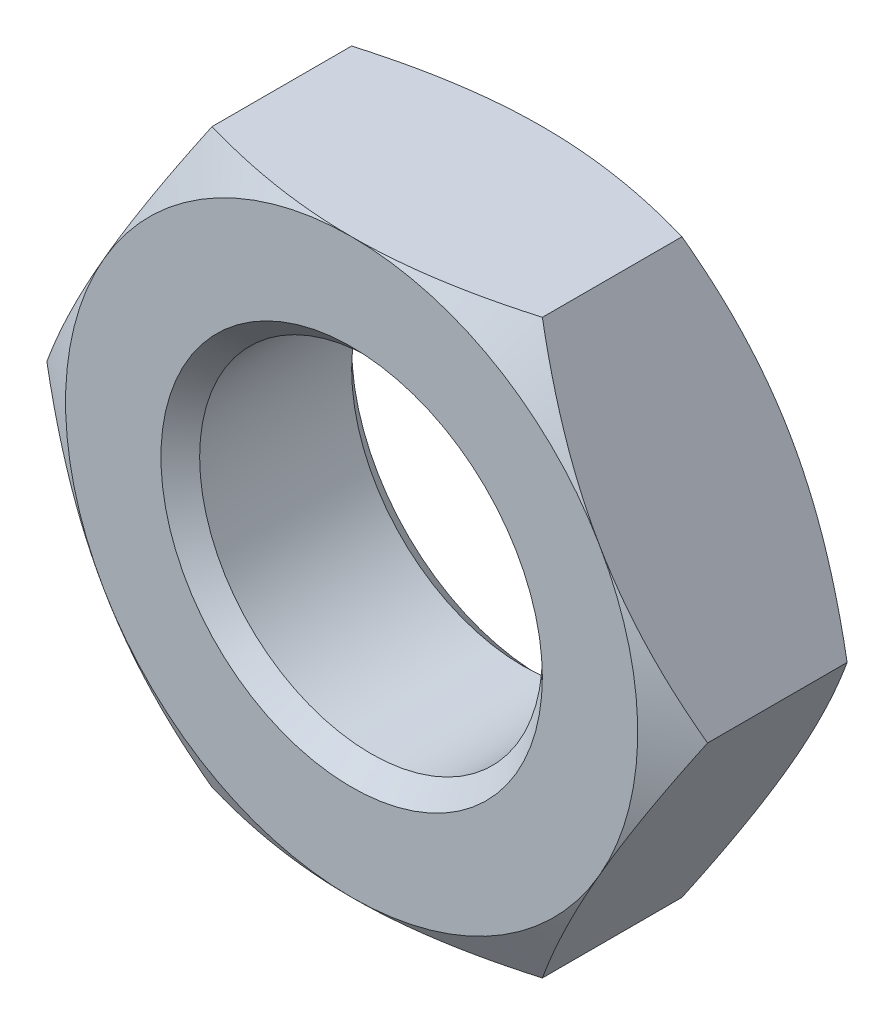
ISO-10303-21;
HEADER;
FILE_DESCRIPTION(('STEP AP214'),'2;1');
FILE_NAME('part.step','',(''),(''),'','','');
FILE_SCHEMA(('AUTOMOTIVE_DESIGN { 1 0 10303 214 1 1 1 1 }'));
ENDSEC;
DATA;
#1=APPLICATION_CONTEXT('core data for automotive mechanical design processes');
#2=APPLICATION_PROTOCOL_DEFINITION('international standard','automotive_design',2000,#1);
#3=PRODUCT_CONTEXT('',#1,'mechanical');
#4=PRODUCT('Part','Part','',(#3));
#5=PRODUCT_RELATED_PRODUCT_CATEGORY('part','',(#4));
#6=PRODUCT_DEFINITION_FORMATION('','',#4);
#7=PRODUCT_DEFINITION_CONTEXT('part definition',#1,'design');
#8=PRODUCT_DEFINITION('design','',#6,#7);
#9=PRODUCT_DEFINITION_SHAPE('','',#8);
#10=(LENGTH_UNIT() NAMED_UNIT(*) SI_UNIT(.MILLI.,.METRE.));
#11=(NAMED_UNIT(*) PLANE_ANGLE_UNIT() SI_UNIT($,.RADIAN.));
#12=(NAMED_UNIT(*) SI_UNIT($,.STERADIAN.) SOLID_ANGLE_UNIT());
#13=UNCERTAINTY_MEASURE_WITH_UNIT(LENGTH_MEASURE(1.E-05),#10,'distance_accuracy_value','');
#14=(GEOMETRIC_REPRESENTATION_CONTEXT(3) GLOBAL_UNCERTAINTY_ASSIGNED_CONTEXT((#13)) GLOBAL_UNIT_ASSIGNED_CONTEXT((#10,
#11,#12)) REPRESENTATION_CONTEXT('',''));
#15=CARTESIAN_POINT('',(0.,0.,0.));
#16=DIRECTION('',(0.,0.,1.));
#17=DIRECTION('',(1.,0.,0.));
#18=AXIS2_PLACEMENT_3D('',#15,#16,#17);
#19=CARTESIAN_POINT('',(0.,1.11022302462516E-13,-8.00000000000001));
#20=DIRECTION('',(0.,0.,1.));
#21=DIRECTION('',(1.,0.,0.));
#22=AXIS2_PLACEMENT_3D('',#19,#20,#21);
#23=PLANE('',#22);
#24=CARTESIAN_POINT('',(0.,1.11022302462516E-13,-8.00000000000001));
#25=DIRECTION('',(0.,0.,-1.));
#26=DIRECTION('',(-1.,0.,0.));
#27=AXIS2_PLACEMENT_3D('',#24,#25,#26);
#28=CIRCLE('',#27,7.99999999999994);
#29=CARTESIAN_POINT('',(-7.99999999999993,1.10578213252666E-13,-8.00000000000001));
#30=VERTEX_POINT('',#29);
#31=EDGE_CURVE('E124',#30,#30,#28,.F.);
#32=ORIENTED_EDGE('',*,*,#31,.T.);
#33=EDGE_LOOP('',(#32));
#34=FACE_BOUND('',#33,.T.);
#35=CARTESIAN_POINT('',(0.,1.11022302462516E-13,-8.000000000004));
#36=DIRECTION('',(0.,0.,1.));
#37=DIRECTION('',(1.,0.,0.));
#38=AXIS2_PLACEMENT_3D('',#35,#36,#37);
#39=CIRCLE('',#38,11.9999999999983);
#40=CARTESIAN_POINT('',(10.3923048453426,6.00000000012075,-8.00000000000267));
#41=VERTEX_POINT('',#40);
#42=CARTESIAN_POINT('',(7.55157186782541E-08,12.0000000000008,-8.00000000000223));
#43=VERTEX_POINT('',#42);
#44=EDGE_CURVE('E622',#41,#43,#39,.T.);
#45=ORIENTED_EDGE('',*,*,#44,.F.);
#46=CARTESIAN_POINT('',(0.,1.11022302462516E-13,-8.00000000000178));
#47=DIRECTION('',(0.,0.,1.));
#48=DIRECTION('',(0.,-1.,0.));
#49=AXIS2_PLACEMENT_3D('',#46,#47,#48);
#50=CIRCLE('',#49,12.0000000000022);
#51=CARTESIAN_POINT('',(10.3923048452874,-6.00000000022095,-8.00000000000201));
#52=VERTEX_POINT('',#51);
#53=EDGE_CURVE('E108',#52,#41,#50,.T.);
#54=ORIENTED_EDGE('',*,*,#53,.F.);
#55=CARTESIAN_POINT('',(0.,1.11022302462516E-13,-8.00000000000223));
#56=DIRECTION('',(0.,0.,1.));
#57=DIRECTION('',(1.,0.,0.));
#58=AXIS2_PLACEMENT_3D('',#55,#56,#57);
#59=CIRCLE('',#58,12.0000000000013);
#60=CARTESIAN_POINT('',(3.29458682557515E-11,-12.0000000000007,-8.00000000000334));
#61=VERTEX_POINT('',#60);
#62=EDGE_CURVE('E20',#61,#52,#59,.T.);
#63=ORIENTED_EDGE('',*,*,#62,.F.);
#64=CARTESIAN_POINT('',(0.,1.11022302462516E-13,-8.000000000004));
#65=DIRECTION('',(0.,0.,1.));
#66=DIRECTION('',(0.,-1.,0.));
#67=AXIS2_PLACEMENT_3D('',#64,#65,#66);
#68=CIRCLE('',#67,11.9999999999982);
#69=CARTESIAN_POINT('',(-10.3923048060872,-6.00000006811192,-8.000000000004));
#70=VERTEX_POINT('',#69);
#71=EDGE_CURVE('E105',#70,#61,#68,.T.);
#72=ORIENTED_EDGE('',*,*,#71,.F.);
#73=CARTESIAN_POINT('',(0.,1.11022302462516E-13,-8.00000000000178));
#74=DIRECTION('',(0.,0.,1.));
#75=DIRECTION('',(1.,0.,0.));
#76=AXIS2_PLACEMENT_3D('',#73,#74,#75);
#77=CIRCLE('',#76,12.0000000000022);
#78=CARTESIAN_POINT('',(-10.3923048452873,6.00000000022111,-8.00000000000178));
#79=VERTEX_POINT('',#78);
#80=EDGE_CURVE('E125',#79,#70,#77,.T.);
#81=ORIENTED_EDGE('',*,*,#80,.F.);
#82=CARTESIAN_POINT('',(0.,1.11022302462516E-13,-8.00000000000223));
#83=DIRECTION('',(0.,0.,1.));
#84=DIRECTION('',(1.,0.,0.));
#85=AXIS2_PLACEMENT_3D('',#82,#83,#84);
#86=CIRCLE('',#85,12.0000000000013);
#87=EDGE_CURVE('E628',#43,#79,#86,.T.);
#88=ORIENTED_EDGE('',*,*,#87,.F.);
#89=EDGE_LOOP('',(#45,#54,#63,#72,#81,#88));
#90=FACE_BOUND('',#89,.T.);
#91=ADVANCED_FACE('F16',(#34,#90),#23,.F.);
#92=CARTESIAN_POINT('',(0.,1.11022302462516E-13,-6.92177244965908));
#93=DIRECTION('',(0.,0.,1.));
#94=DIRECTION('',(1.,0.,0.));
#95=AXIS2_PLACEMENT_3D('',#92,#93,#94);
#96=CONICAL_SURFACE('',#95,13.8675448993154,1.0471975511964);
#97=CARTESIAN_POINT('',(5.76205749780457E-11,-12.,-8.00000000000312));
#98=CARTESIAN_POINT('',(0.294063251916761,-12.,-8.00004934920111));
#99=CARTESIAN_POINT('',(0.588112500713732,-12.,-7.99376065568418));
#100=CARTESIAN_POINT('',(1.17563362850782,-12.,-7.96887261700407));
#101=CARTESIAN_POINT('',(1.46910561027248,-12.,-7.95027570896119));
#102=CARTESIAN_POINT('',(2.05357628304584,-12.,-7.90125913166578));
#103=CARTESIAN_POINT('',(2.34458000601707,-12.,-7.87089898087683));
#104=CARTESIAN_POINT('',(2.92520230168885,-12.,-7.799004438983));
#105=CARTESIAN_POINT('',(3.21482083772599,-12.,-7.75746975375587));
#106=CARTESIAN_POINT('',(3.79202295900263,-12.,-7.66407312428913));
#107=CARTESIAN_POINT('',(4.07960857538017,-12.,-7.61222368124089));
#108=CARTESIAN_POINT('',(4.65290698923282,-12.,-7.49904993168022));
#109=CARTESIAN_POINT('',(4.93861967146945,-12.,-7.43772504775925));
#110=CARTESIAN_POINT('',(5.79563880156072,-12.,-7.24024473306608));
#111=CARTESIAN_POINT('',(6.36399154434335,-12.,-7.09105920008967));
#112=CARTESIAN_POINT('',(6.92820323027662,-12.0000000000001,-6.92820323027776));
#113=B_SPLINE_CURVE_WITH_KNOTS('',3,(#97,#98,#99,#100,#101,#102,#103,#104,#105,#106,#107,#108,
#109,#110,#111,#112),.UNSPECIFIED.,.F.,.F.,(4,2,2,2,2,2,2,4),(0.,0.882100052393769,
1.7640254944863,2.64154573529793,3.5190890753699,4.39557526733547,5.27211489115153,
7.03380287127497),.UNSPECIFIED.);
#114=CARTESIAN_POINT('',(6.92820323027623,-12.0000000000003,-6.92820323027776));
#115=VERTEX_POINT('',#114);
#116=EDGE_CURVE('E127',#61,#115,#113,.T.);
#117=ORIENTED_EDGE('',*,*,#116,.F.);
#118=ORIENTED_EDGE('',*,*,#62,.T.);
#119=CARTESIAN_POINT('',(6.92820323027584,-12.0000000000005,-6.92820323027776));
#120=CARTESIAN_POINT('',(7.21030907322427,-11.5113783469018,-7.09105920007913));
#121=CARTESIAN_POINT('',(7.49448544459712,-11.0191704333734,-7.24024473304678));
#122=CARTESIAN_POINT('',(7.92299500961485,-10.2769700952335,-7.43772504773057));
#123=CARTESIAN_POINT('',(8.06585135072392,-10.0295356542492,-7.49904993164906));
#124=CARTESIAN_POINT('',(8.35250055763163,-9.53304466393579,-7.61222368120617));
#125=CARTESIAN_POINT('',(8.49629336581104,-9.28398821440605,-7.66407312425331));
#126=CARTESIAN_POINT('',(8.78489442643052,-8.78411651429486,-7.7574697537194));
#127=CARTESIAN_POINT('',(8.92970369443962,-8.53329950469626,-7.79900443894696));
#128=CARTESIAN_POINT('',(9.22001484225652,-8.03046584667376,-7.87089898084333));
#129=CARTESIAN_POINT('',(9.36551670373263,-7.77844923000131,-7.90125913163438));
#130=CARTESIAN_POINT('',(9.65775204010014,-7.27228277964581,-7.95027570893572));
#131=CARTESIAN_POINT('',(9.80448803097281,-7.01812858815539,-7.96887261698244));
#132=CARTESIAN_POINT('',(10.0982485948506,-6.50932036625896,-7.99376065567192));
#133=CARTESIAN_POINT('',(10.2452732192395,-6.25466624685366,-8.00004934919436));
#134=CARTESIAN_POINT('',(10.3923048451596,-6.00000000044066,-8.00000000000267));
#135=B_SPLINE_CURVE_WITH_KNOTS('',3,(#119,#120,#121,#122,#123,#124,#125,#126,#127,#128,#129,
#130,#131,#132,#133,#134),.UNSPECIFIED.,.F.,.F.,(4,2,2,2,2,2,2,4),(0.,1.76168798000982,
2.63822760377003,3.51471379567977,4.39225713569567,5.26977737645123,6.1517028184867,
7.03380287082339),.UNSPECIFIED.);
#136=EDGE_CURVE('E130',#115,#52,#135,.T.);
#137=ORIENTED_EDGE('',*,*,#136,.F.);
#138=EDGE_LOOP('',(#117,#118,#137));
#139=FACE_BOUND('',#138,.T.);
#140=ADVANCED_FACE('F128',(#139),#96,.T.);
#141=CARTESIAN_POINT('',(0.,1.11022302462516E-13,-6.92177244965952));
#142=DIRECTION('',(0.,0.,1.));
#143=DIRECTION('',(0.,-1.,0.));
#144=AXIS2_PLACEMENT_3D('',#141,#142,#143);
#145=CONICAL_SURFACE('',#144,13.8675448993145,1.0471975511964);
#146=CARTESIAN_POINT('',(13.8564064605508,-9.43689570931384E-13,-6.92820323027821));
#147=CARTESIAN_POINT('',(13.5743006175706,0.488621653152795,-7.09105920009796));
#148=CARTESIAN_POINT('',(13.2901242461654,0.980829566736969,-7.24024473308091));
#149=CARTESIAN_POINT('',(12.861614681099,1.72302990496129,-7.43772504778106));
#150=CARTESIAN_POINT('',(12.7187583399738,1.97046434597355,-7.49904993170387));
#151=CARTESIAN_POINT('',(12.4321091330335,2.46695533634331,-7.6122236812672));
#152=CARTESIAN_POINT('',(12.2883163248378,2.71601178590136,-7.66407312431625));
#153=CARTESIAN_POINT('',(11.9997152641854,3.21588348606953,-7.75746975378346));
#154=CARTESIAN_POINT('',(11.8549059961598,3.46670049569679,-7.79900443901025));
#155=CARTESIAN_POINT('',(11.5645948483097,3.96953415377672,-7.87089898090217));
#156=CARTESIAN_POINT('',(11.419092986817,4.22155077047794,-7.90125913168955));
#157=CARTESIAN_POINT('',(11.126857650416,4.72771722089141,-7.95027570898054));
#158=CARTESIAN_POINT('',(10.9801216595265,4.98187141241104,-7.96887261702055));
#159=CARTESIAN_POINT('',(10.6863610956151,5.49067963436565,-7.99376065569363));
#160=CARTESIAN_POINT('',(10.5393364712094,5.74533375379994,-8.00004934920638));
#161=CARTESIAN_POINT('',(10.3923048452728,6.00000000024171,-8.00000000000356));
#162=B_SPLINE_CURVE_WITH_KNOTS('',3,(#146,#147,#148,#149,#150,#151,#152,#153,#154,#155,#156,
#157,#158,#159,#160,#161),.UNSPECIFIED.,.F.,.F.,(4,2,2,2,2,2,2,4),(0.,1.76168798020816,
2.63822760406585,3.51471379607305,4.39225713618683,5.26977737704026,6.15170281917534,
7.03380287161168),.UNSPECIFIED.);
#163=CARTESIAN_POINT('',(13.8564064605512,-6.10622663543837E-13,-6.92820323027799));
#164=VERTEX_POINT('',#163);
#165=EDGE_CURVE('E304',#164,#41,#162,.T.);
#166=ORIENTED_EDGE('',*,*,#165,.F.);
#167=CARTESIAN_POINT('',(10.3923048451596,-6.00000000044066,-8.00000000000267));
#168=CARTESIAN_POINT('',(10.5393364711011,-5.74533375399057,-8.00004934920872));
#169=CARTESIAN_POINT('',(10.6863610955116,-5.49067963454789,-7.99376065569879));
#170=CARTESIAN_POINT('',(10.9801216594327,-4.98187141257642,-7.96887261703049));
#171=CARTESIAN_POINT('',(11.1268576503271,-4.72771722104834,-7.95027570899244));
#172=CARTESIAN_POINT('',(11.4190929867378,-4.22155077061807,-7.90125913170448));
#173=CARTESIAN_POINT('',(11.5645948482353,-3.96953415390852,-7.87089898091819));
#174=CARTESIAN_POINT('',(11.854905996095,-3.46670049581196,-7.79900443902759));
#175=CARTESIAN_POINT('',(11.9997152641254,-3.2158834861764,-7.75746975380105));
#176=CARTESIAN_POINT('',(12.2883163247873,-2.71601178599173,-7.66407312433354));
#177=CARTESIAN_POINT('',(12.4321091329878,-2.46695533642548,-7.61222368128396));
#178=CARTESIAN_POINT('',(12.7187583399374,-1.97046434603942,-7.49904993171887));
#179=CARTESIAN_POINT('',(12.8616146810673,-1.72302990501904,-7.43772504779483));
#180=CARTESIAN_POINT('',(13.2901242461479,-0.980829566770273,-7.24024473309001));
#181=CARTESIAN_POINT('',(13.5743006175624,-0.488621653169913,-7.0910592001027));
#182=CARTESIAN_POINT('',(13.8564064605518,-2.22044604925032E-13,-6.92820323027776));
#183=B_SPLINE_CURVE_WITH_KNOTS('',3,(#167,#168,#169,#170,#171,#172,#173,#174,#175,#176,#177,
#178,#179,#180,#181,#182),.UNSPECIFIED.,.F.,.F.,(4,2,2,2,2,2,2,4),(0.,0.882100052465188,
1.76402549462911,2.64154573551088,3.51908907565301,4.39557526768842,5.27211489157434,
7.03380287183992),.UNSPECIFIED.);
#184=EDGE_CURVE('E305',#52,#164,#183,.T.);
#185=ORIENTED_EDGE('',*,*,#184,.F.);
#186=ORIENTED_EDGE('',*,*,#53,.T.);
#187=EDGE_LOOP('',(#166,#185,#186));
#188=FACE_BOUND('',#187,.T.);
#189=ADVANCED_FACE('F327',(#188),#145,.T.);
#190=CARTESIAN_POINT('',(0.,1.11022302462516E-13,-6.92177244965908));
#191=DIRECTION('',(0.,0.,1.));
#192=DIRECTION('',(1.,0.,0.));
#193=AXIS2_PLACEMENT_3D('',#190,#191,#192);
#194=CONICAL_SURFACE('',#193,13.8675448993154,1.0471975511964);
#195=CARTESIAN_POINT('',(10.3923048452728,6.00000000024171,-8.00000000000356));
#196=CARTESIAN_POINT('',(10.2452732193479,6.25466624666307,-8.00004934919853));
#197=CARTESIAN_POINT('',(10.0982485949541,6.50932036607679,-7.99376065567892));
#198=CARTESIAN_POINT('',(9.80448803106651,7.01812858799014,-7.96887261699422));
#199=CARTESIAN_POINT('',(9.65775204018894,7.27228277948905,-7.95027570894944));
#200=CARTESIAN_POINT('',(9.36551670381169,7.77844922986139,-7.90125913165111));
#201=CARTESIAN_POINT('',(9.22001484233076,8.03046584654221,-7.87089898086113));
#202=CARTESIAN_POINT('',(8.92970369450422,8.53329950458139,-7.79900443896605));
#203=CARTESIAN_POINT('',(8.78489442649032,8.78411651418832,-7.75746975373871));
#204=CARTESIAN_POINT('',(8.49629336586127,9.28398821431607,-7.66407312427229));
#205=CARTESIAN_POINT('',(8.35250055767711,9.53304466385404,-7.61222368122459));
#206=CARTESIAN_POINT('',(8.06585135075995,10.0295356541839,-7.49904993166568));
#207=CARTESIAN_POINT('',(7.92299500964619,10.2769700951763,-7.43772504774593));
#208=CARTESIAN_POINT('',(7.4944854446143,11.0191704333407,-7.24024473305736));
#209=CARTESIAN_POINT('',(7.21030907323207,11.5113783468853,-7.09105920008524));
#210=CARTESIAN_POINT('',(6.9282032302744,12.,-6.92820323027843));
#211=B_SPLINE_CURVE_WITH_KNOTS('',3,(#195,#196,#197,#198,#199,#200,#201,#202,#203,#204,#205,
#206,#207,#208,#209,#210),.UNSPECIFIED.,.F.,.F.,(4,2,2,2,2,2,2,4),(0.,0.882100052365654,
1.76402549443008,2.64154573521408,3.51908907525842,4.39557526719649,5.27211489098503,
7.0338028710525),.UNSPECIFIED.);
#212=CARTESIAN_POINT('',(6.92820323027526,12.0000000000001,-6.92820323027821));
#213=VERTEX_POINT('',#212);
#214=EDGE_CURVE('E299',#41,#213,#211,.T.);
#215=ORIENTED_EDGE('',*,*,#214,.F.);
#216=ORIENTED_EDGE('',*,*,#44,.T.);
#217=CARTESIAN_POINT('',(6.92820323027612,12.0000000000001,-6.92820323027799));
#218=CARTESIAN_POINT('',(6.36399155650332,12.0000000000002,-7.09105919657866));
#219=CARTESIAN_POINT('',(5.79563882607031,12.0000000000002,-7.24024472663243));
#220=CARTESIAN_POINT('',(4.93861971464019,12.0000000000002,-7.43772503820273));
#221=CARTESIAN_POINT('',(4.65290703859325,12.0000000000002,-7.49904992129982));
#222=CARTESIAN_POINT('',(4.07960863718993,12.0000000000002,-7.61222366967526));
#223=CARTESIAN_POINT('',(3.79202302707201,12.0000000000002,-7.66407311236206));
#224=CARTESIAN_POINT('',(3.21482091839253,12.0000000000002,-7.75746974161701));
#225=CARTESIAN_POINT('',(2.92520238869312,12.0000000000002,-7.7990044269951));
#226=CARTESIAN_POINT('',(2.3445801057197,12.0000000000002,-7.87089896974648));
#227=CARTESIAN_POINT('',(2.05357638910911,12.0000000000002,-7.90125912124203));
#228=CARTESIAN_POINT('',(1.46910572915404,12.0000000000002,-7.95027570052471));
#229=CARTESIAN_POINT('',(1.17563375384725,12.0000000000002,-7.96887260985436));
#230=CARTESIAN_POINT('',(0.588112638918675,12.0000000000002,-7.99376065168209));
#231=CARTESIAN_POINT('',(0.294063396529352,12.0000000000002,-8.00004934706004));
#232=CARTESIAN_POINT('',(1.51031381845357E-07,12.0000000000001,-8.00000000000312));
#233=B_SPLINE_CURVE_WITH_KNOTS('',3,(#217,#218,#219,#220,#221,#222,#223,#224,#225,#226,#227,
#228,#229,#230,#231,#232),.UNSPECIFIED.,.F.,.F.,(4,2,2,2,2,2,2,4),(0.,1.7616879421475,
2.63822754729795,3.51471372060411,4.39225704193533,5.26977726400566,6.15170268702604,
7.03380272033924),.UNSPECIFIED.);
#234=EDGE_CURVE('E298',#213,#43,#233,.T.);
#235=ORIENTED_EDGE('',*,*,#234,.F.);
#236=EDGE_LOOP('',(#215,#216,#235));
#237=FACE_BOUND('',#236,.T.);
#238=ADVANCED_FACE('F332',(#237),#194,.T.);
#239=CARTESIAN_POINT('',(0.,1.11022302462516E-13,-6.92177244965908));
#240=DIRECTION('',(0.,0.,1.));
#241=DIRECTION('',(1.,0.,0.));
#242=AXIS2_PLACEMENT_3D('',#239,#240,#241);
#243=CONICAL_SURFACE('',#242,13.8675448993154,1.0471975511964);
#244=CARTESIAN_POINT('',(1.51031381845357E-07,12.0000000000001,-8.00000000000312));
#245=CARTESIAN_POINT('',(-0.294063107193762,12.0000000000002,-8.00004935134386));
#246=CARTESIAN_POINT('',(-0.588112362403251,12.0000000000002,-7.9937606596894));
#247=CARTESIAN_POINT('',(-1.17563350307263,12.0000000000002,-7.96887262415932));
#248=CARTESIAN_POINT('',(-1.46910549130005,12.0000000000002,-7.9502757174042));
#249=CARTESIAN_POINT('',(-2.05357617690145,12.0000000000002,-7.90125914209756));
#250=CARTESIAN_POINT('',(-2.34457990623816,12.0000000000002,-7.87089899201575));
#251=CARTESIAN_POINT('',(-2.92520221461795,12.0000000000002,-7.79900445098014));
#252=CARTESIAN_POINT('',(-3.21482075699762,12.0000000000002,-7.7574697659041));
#253=CARTESIAN_POINT('',(-3.79202289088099,12.0000000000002,-7.66407313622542));
#254=CARTESIAN_POINT('',(-4.0796085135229,12.0000000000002,-7.61222369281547));
#255=CARTESIAN_POINT('',(-4.65290693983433,12.0000000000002,-7.49904994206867));
#256=CARTESIAN_POINT('',(-4.93861962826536,12.0000000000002,-7.43772505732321));
#257=CARTESIAN_POINT('',(-5.79563877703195,12.0000000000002,-7.24024473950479));
#258=CARTESIAN_POINT('',(-6.36399153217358,12.0000000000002,-7.09105920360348));
#259=CARTESIAN_POINT('',(-6.92820323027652,12.0000000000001,-6.92820323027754));
#260=B_SPLINE_CURVE_WITH_KNOTS('',3,(#244,#245,#246,#247,#248,#249,#250,#251,#252,#253,#254,
#255,#256,#257,#258,#259),.UNSPECIFIED.,.F.,.F.,(4,2,2,2,2,2,2,4),(0.,0.882100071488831,
1.76402553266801,2.64154579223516,3.51908915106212,4.39557536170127,5.27211500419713,
7.03380302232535),.UNSPECIFIED.);
#261=CARTESIAN_POINT('',(-6.92820323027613,12.0000000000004,-6.92820323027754));
#262=VERTEX_POINT('',#261);
#263=EDGE_CURVE('E293',#43,#262,#260,.T.);
#264=ORIENTED_EDGE('',*,*,#263,.F.);
#265=ORIENTED_EDGE('',*,*,#87,.T.);
#266=CARTESIAN_POINT('',(-6.92820323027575,12.0000000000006,-6.92820323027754));
#267=CARTESIAN_POINT('',(-7.21030907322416,11.5113783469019,-7.09105920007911));
#268=CARTESIAN_POINT('',(-7.494485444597,11.0191704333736,-7.24024473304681));
#269=CARTESIAN_POINT('',(-7.92299500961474,10.2769700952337,-7.43772504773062));
#270=CARTESIAN_POINT('',(-8.0658513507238,10.0295356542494,-7.49904993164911));
#271=CARTESIAN_POINT('',(-8.35250055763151,9.53304466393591,-7.61222368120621));
#272=CARTESIAN_POINT('',(-8.49629336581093,9.28398821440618,-7.66407312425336));
#273=CARTESIAN_POINT('',(-8.78489442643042,8.78411651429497,-7.75746975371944));
#274=CARTESIAN_POINT('',(-8.92970369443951,8.53329950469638,-7.799004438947));
#275=CARTESIAN_POINT('',(-9.22001484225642,8.03046584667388,-7.87089898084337));
#276=CARTESIAN_POINT('',(-9.36551670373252,7.77844923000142,-7.90125913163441));
#277=CARTESIAN_POINT('',(-9.65775204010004,7.27228277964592,-7.95027570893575));
#278=CARTESIAN_POINT('',(-9.80448803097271,7.0181285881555,-7.96887261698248));
#279=CARTESIAN_POINT('',(-10.0982485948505,6.50932036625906,-7.99376065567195));
#280=CARTESIAN_POINT('',(-10.2452732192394,6.25466624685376,-8.00004934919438));
#281=CARTESIAN_POINT('',(-10.3923048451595,6.00000000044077,-8.00000000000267));
#282=B_SPLINE_CURVE_WITH_KNOTS('',3,(#266,#267,#268,#269,#270,#271,#272,#273,#274,#275,#276,
#277,#278,#279,#280,#281),.UNSPECIFIED.,.F.,.F.,(4,2,2,2,2,2,2,4),(0.,1.76168798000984,
2.63822760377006,3.51471379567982,4.39225713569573,5.26977737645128,6.15170281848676,
7.03380287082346),.UNSPECIFIED.);
#283=EDGE_CURVE('E292',#262,#79,#282,.T.);
#284=ORIENTED_EDGE('',*,*,#283,.F.);
#285=EDGE_LOOP('',(#264,#265,#284));
#286=FACE_BOUND('',#285,.T.);
#287=ADVANCED_FACE('F547',(#286),#243,.T.);
#288=CARTESIAN_POINT('',(0.,1.11022302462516E-13,-6.92177244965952));
#289=DIRECTION('',(0.,0.,1.));
#290=DIRECTION('',(1.,0.,0.));
#291=AXIS2_PLACEMENT_3D('',#288,#289,#290);
#292=CONICAL_SURFACE('',#291,13.8675448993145,1.0471975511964);
#293=CARTESIAN_POINT('',(-13.8564064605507,1.16573417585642E-12,-6.92820323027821));
#294=CARTESIAN_POINT('',(-13.5743006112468,-0.48862166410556,-7.09105920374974));
#295=CARTESIAN_POINT('',(-13.2901242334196,-0.980829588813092,-7.24024473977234));
#296=CARTESIAN_POINT('',(-12.8616146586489,-1.72302994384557,-7.43772505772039));
#297=CARTESIAN_POINT('',(-12.7187583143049,-1.97046439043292,-7.49904994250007));
#298=CARTESIAN_POINT('',(-12.4321091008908,-2.46695539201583,-7.61222369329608));
#299=CARTESIAN_POINT('',(-12.2883162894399,-2.71601184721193,-7.66407313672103));
#300=CARTESIAN_POINT('',(-11.9997152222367,-3.21588355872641,-7.75746976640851));
#301=CARTESIAN_POINT('',(-11.8549059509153,-3.46670057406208,-7.79900445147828));
#302=CARTESIAN_POINT('',(-11.5645947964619,-3.96953424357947,-7.87089899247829));
#303=CARTESIAN_POINT('',(-11.4190929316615,-4.22155086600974,-7.90125914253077));
#304=CARTESIAN_POINT('',(-11.1268575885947,-4.72771732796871,-7.95027571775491));
#305=CARTESIAN_POINT('',(-10.9801215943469,-4.98187152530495,-7.96887262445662));
#306=CARTESIAN_POINT('',(-10.6863610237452,-5.49067975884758,-7.99376065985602));
#307=CARTESIAN_POINT('',(-10.5393363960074,-5.74533388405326,-8.00004935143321));
#308=CARTESIAN_POINT('',(-10.3923047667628,-6.00000013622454,-8.00000000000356));
#309=B_SPLINE_CURVE_WITH_KNOTS('',3,(#293,#294,#295,#296,#297,#298,#299,#300,#301,#302,#303,
#304,#305,#306,#307,#308),.UNSPECIFIED.,.F.,.F.,(4,2,2,2,2,2,2,4),(0.,1.76168801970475,
2.63822766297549,3.51471387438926,4.39225723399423,5.26977749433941,6.15170295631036,
7.0338030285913),.UNSPECIFIED.);
#310=CARTESIAN_POINT('',(-13.8564064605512,8.32667268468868E-13,-6.92820323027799));
#311=VERTEX_POINT('',#310);
#312=EDGE_CURVE('E174',#311,#70,#309,.T.);
#313=ORIENTED_EDGE('',*,*,#312,.F.);
#314=CARTESIAN_POINT('',(-10.3923048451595,6.00000000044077,-8.00000000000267));
#315=CARTESIAN_POINT('',(-10.539336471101,5.74533375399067,-8.00004934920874));
#316=CARTESIAN_POINT('',(-10.6863610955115,5.49067963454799,-7.99376065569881));
#317=CARTESIAN_POINT('',(-10.9801216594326,4.98187141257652,-7.96887261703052));
#318=CARTESIAN_POINT('',(-11.126857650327,4.72771722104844,-7.95027570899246));
#319=CARTESIAN_POINT('',(-11.4190929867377,4.22155077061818,-7.9012591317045));
#320=CARTESIAN_POINT('',(-11.5645948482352,3.96953415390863,-7.87089898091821));
#321=CARTESIAN_POINT('',(-11.8549059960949,3.46670049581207,-7.79900443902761));
#322=CARTESIAN_POINT('',(-11.9997152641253,3.21588348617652,-7.75746975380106));
#323=CARTESIAN_POINT('',(-12.2883163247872,2.71601178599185,-7.66407312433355));
#324=CARTESIAN_POINT('',(-12.4321091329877,2.4669553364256,-7.61222368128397));
#325=CARTESIAN_POINT('',(-12.7187583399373,1.97046434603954,-7.49904993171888));
#326=CARTESIAN_POINT('',(-12.8616146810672,1.72302990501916,-7.43772504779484));
#327=CARTESIAN_POINT('',(-13.2901242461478,0.980829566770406,-7.24024473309));
#328=CARTESIAN_POINT('',(-13.5743006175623,0.488621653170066,-7.09105920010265));
#329=CARTESIAN_POINT('',(-13.8564064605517,4.44089209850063E-13,-6.92820323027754));
#330=B_SPLINE_CURVE_WITH_KNOTS('',3,(#314,#315,#316,#317,#318,#319,#320,#321,#322,#323,#324,
#325,#326,#327,#328,#329),.UNSPECIFIED.,.F.,.F.,(4,2,2,2,2,2,2,4),(0.,0.882100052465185,
1.7640254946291,2.64154573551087,3.51908907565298,4.39557526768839,5.27211489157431,
7.03380287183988),.UNSPECIFIED.);
#331=EDGE_CURVE('E412',#79,#311,#330,.T.);
#332=ORIENTED_EDGE('',*,*,#331,.F.);
#333=ORIENTED_EDGE('',*,*,#80,.T.);
#334=EDGE_LOOP('',(#313,#332,#333));
#335=FACE_BOUND('',#334,.T.);
#336=ADVANCED_FACE('F163',(#335),#292,.T.);
#337=CARTESIAN_POINT('',(0.,1.11022302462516E-13,-6.92177244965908));
#338=DIRECTION('',(0.,0.,1.));
#339=DIRECTION('',(0.,-1.,0.));
#340=AXIS2_PLACEMENT_3D('',#337,#338,#339);
#341=CONICAL_SURFACE('',#340,13.8675448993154,1.0471975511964);
#342=CARTESIAN_POINT('',(-10.3923047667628,-6.00000013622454,-8.00000000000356));
#343=CARTESIAN_POINT('',(-10.2452731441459,-6.25466637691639,-8.00004934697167));
#344=CARTESIAN_POINT('',(-10.0982485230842,-6.50932049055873,-7.9937606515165));
#345=CARTESIAN_POINT('',(-9.80448796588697,-7.01812870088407,-7.96887260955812));
#346=CARTESIAN_POINT('',(-9.65775197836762,-7.27228288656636,-7.95027570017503));
#347=CARTESIAN_POINT('',(-9.36551664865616,-7.77844932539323,-7.90125912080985));
#348=CARTESIAN_POINT('',(-9.2200147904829,-8.030465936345,-7.87089896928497));
#349=CARTESIAN_POINT('',(-8.92970364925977,-8.53329958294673,-7.79900442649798));
#350=CARTESIAN_POINT('',(-8.78489438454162,-8.78411658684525,-7.75746974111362));
#351=CARTESIAN_POINT('',(-8.49629333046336,-9.2839882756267,-7.66407311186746));
#352=CARTESIAN_POINT('',(-8.35250052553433,-9.53304471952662,-7.61222366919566));
#353=CARTESIAN_POINT('',(-8.06585132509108,-10.0295356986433,-7.49904992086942));
#354=CARTESIAN_POINT('',(-7.9229949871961,-10.2769701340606,-7.43772503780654));
#355=CARTESIAN_POINT('',(-7.49448543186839,-11.0191704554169,-7.24024472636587));
#356=CARTESIAN_POINT('',(-7.21030906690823,-11.5113783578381,-7.09105919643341));
#357=CARTESIAN_POINT('',(-6.92820323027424,-11.9999999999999,-6.92820323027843));
#358=B_SPLINE_CURVE_WITH_KNOTS('',3,(#342,#343,#344,#345,#346,#347,#348,#349,#350,#351,#352,
#353,#354,#355,#356,#357),.UNSPECIFIED.,.F.,.F.,(4,2,2,2,2,2,2,4),(0.,0.882100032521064,
1.76402545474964,2.64154567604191,3.51908899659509,4.39557516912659,5.27211477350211,
7.03380271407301),.UNSPECIFIED.);
#359=CARTESIAN_POINT('',(-6.92820323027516,-11.9999999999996,-6.92820323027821));
#360=VERTEX_POINT('',#359);
#361=EDGE_CURVE('E121',#70,#360,#358,.T.);
#362=ORIENTED_EDGE('',*,*,#361,.F.);
#363=ORIENTED_EDGE('',*,*,#71,.T.);
#364=CARTESIAN_POINT('',(-6.92820323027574,-12.,-6.92820323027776));
#365=CARTESIAN_POINT('',(-6.3639915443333,-12.,-7.09105920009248));
#366=CARTESIAN_POINT('',(-5.79563880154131,-12.,-7.24024473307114));
#367=CARTESIAN_POINT('',(-4.9386196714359,-12.,-7.43772504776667));
#368=CARTESIAN_POINT('',(-4.65290698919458,-12.,-7.49904993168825));
#369=CARTESIAN_POINT('',(-4.0796085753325,-12.,-7.6122236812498));
#370=CARTESIAN_POINT('',(-3.79202295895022,-12.,-7.66407312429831));
#371=CARTESIAN_POINT('',(-3.21482083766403,-12.,-7.75746975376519));
#372=CARTESIAN_POINT('',(-2.92520230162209,-12.,-7.79900443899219));
#373=CARTESIAN_POINT('',(-2.34458000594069,-12.,-7.87089898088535));
#374=CARTESIAN_POINT('',(-2.05357628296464,-12.,-7.90125913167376));
#375=CARTESIAN_POINT('',(-1.46910561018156,-12.,-7.95027570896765));
#376=CARTESIAN_POINT('',(-1.17563362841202,-12.,-7.96887261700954));
#377=CARTESIAN_POINT('',(-0.588112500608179,-12.,-7.99376065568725));
#378=CARTESIAN_POINT('',(-0.294063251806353,-12.,-8.00004934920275));
#379=CARTESIAN_POINT('',(5.76066971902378E-11,-12.,-8.00000000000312));
#380=B_SPLINE_CURVE_WITH_KNOTS('',3,(#364,#365,#366,#367,#368,#369,#370,#371,#372,#373,#374,
#375,#376,#377,#378,#379),.UNSPECIFIED.,.F.,.F.,(4,2,2,2,2,2,2,4),(0.,1.76168798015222,
2.63822760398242,3.51471379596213,4.3922571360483,5.26977737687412,6.1517028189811,
7.03380287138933),.UNSPECIFIED.);
#381=EDGE_CURVE('E118',#360,#61,#380,.T.);
#382=ORIENTED_EDGE('',*,*,#381,.F.);
#383=EDGE_LOOP('',(#362,#363,#382));
#384=FACE_BOUND('',#383,.T.);
#385=ADVANCED_FACE('F116',(#384),#341,.T.);
#386=CARTESIAN_POINT('',(0.,1.11022302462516E-13,-8.00000000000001));
#387=DIRECTION('',(0.,0.,-1.));
#388=DIRECTION('',(-1.,0.,0.));
#389=AXIS2_PLACEMENT_3D('',#386,#387,#388);
#390=CONICAL_SURFACE('',#389,7.99999999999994,0.785398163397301);
#391=CARTESIAN_POINT('',(0.,1.11022302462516E-13,-7.18799999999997));
#392=DIRECTION('',(0.,0.,1.));
#393=DIRECTION('',(1.,0.,0.));
#394=AXIS2_PLACEMENT_3D('',#391,#392,#393);
#395=CIRCLE('',#394,7.188);
#396=CARTESIAN_POINT('',(7.18800000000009,1.11421316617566E-13,-7.18799999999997));
#397=VERTEX_POINT('',#396);
#398=EDGE_CURVE('E276',#397,#397,#395,.T.);
#399=ORIENTED_EDGE('',*,*,#398,.T.);
#400=EDGE_LOOP('',(#399));
#401=FACE_BOUND('',#400,.T.);
#402=ORIENTED_EDGE('',*,*,#31,.F.);
#403=EDGE_LOOP('',(#402));
#404=FACE_BOUND('',#403,.T.);
#405=ADVANCED_FACE('F162',(#401,#404),#390,.F.);
#406=CARTESIAN_POINT('',(-6.92820323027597,-12.,2.22044604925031E-13));
#407=DIRECTION('',(0.,-1.,0.));
#408=DIRECTION('',(0.,0.,-1.));
#409=AXIS2_PLACEMENT_3D('',#406,#407,#408);
#410=PLANE('',#409);
#411=CARTESIAN_POINT('',(-7.86037901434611E-11,-12.,2.88657986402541E-12));
#412=CARTESIAN_POINT('',(0.294063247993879,-12.,4.93492004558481E-05));
#413=CARTESIAN_POINT('',(0.588112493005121,-12.,-0.0062393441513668));
#414=CARTESIAN_POINT('',(1.1756336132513,-12.,-0.0311273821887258));
#415=CARTESIAN_POINT('',(1.46910559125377,-12.,-0.0497242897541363));
#416=CARTESIAN_POINT('',(2.05357625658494,-12.,-0.0987408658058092));
#417=CARTESIAN_POINT('',(2.34457997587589,-12.,-0.129101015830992));
#418=CARTESIAN_POINT('',(2.9252022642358,-12.,-0.200995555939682));
#419=CARTESIAN_POINT('',(3.21482079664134,-12.,-0.242530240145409));
#420=CARTESIAN_POINT('',(3.79202291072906,-12.,-0.33592686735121));
#421=CARTESIAN_POINT('',(4.07960852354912,-12.,-0.387776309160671));
#422=CARTESIAN_POINT('',(4.65290693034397,-12.,-0.500950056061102));
#423=CARTESIAN_POINT('',(4.93861960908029,-12.,-0.562274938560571));
#424=CARTESIAN_POINT('',(5.7956387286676,-12.,-0.759755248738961));
#425=CARTESIAN_POINT('',(6.36399146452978,-12.,-0.90894077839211));
#426=CARTESIAN_POINT('',(6.92820314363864,-12.0000000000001,-1.07179674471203));
#427=B_SPLINE_CURVE_WITH_KNOTS('',3,(#411,#412,#413,#414,#415,#416,#417,#418,#419,#420,#421,
#422,#423,#424,#425,#426),.UNSPECIFIED.,.F.,.F.,(4,2,2,2,2,2,2,4),(0.,0.882100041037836,
1.76402547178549,2.64154570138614,3.51908903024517,4.39557521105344,5.27211482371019,
7.03380278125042),.UNSPECIFIED.);
#428=CARTESIAN_POINT('',(-7.86037901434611E-11,-12.0000000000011,2.22044604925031E-12));
#429=VERTEX_POINT('',#428);
#430=CARTESIAN_POINT('',(6.92820322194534,-12.0000000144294,-1.07179677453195));
#431=VERTEX_POINT('',#430);
#432=EDGE_CURVE('E417',#429,#431,#427,.T.);
#433=ORIENTED_EDGE('',*,*,#432,.F.);
#434=CARTESIAN_POINT('',(-6.92820326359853,-12.,-1.07179677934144));
#435=CARTESIAN_POINT('',(-6.36399157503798,-12.,-0.908940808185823));
#436=CARTESIAN_POINT('',(-5.7956388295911,-12.,-0.759755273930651));
#437=CARTESIAN_POINT('',(-4.93861969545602,-12.,-0.562274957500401));
#438=CARTESIAN_POINT('',(-4.65290701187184,-12.,-0.500950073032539));
#439=CARTESIAN_POINT('',(-4.07960859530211,-12.,-0.387776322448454));
#440=CARTESIAN_POINT('',(-3.79202297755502,-12.,-0.335926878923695));
#441=CARTESIAN_POINT('',(-3.21482085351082,-12.,-0.242530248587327));
#442=CARTESIAN_POINT('',(-2.92520231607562,-12.,-0.200995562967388));
#443=CARTESIAN_POINT('',(-2.34458001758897,-12.,-0.129101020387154));
#444=CARTESIAN_POINT('',(-2.05357629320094,-12.,-0.0987408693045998));
#445=CARTESIAN_POINT('',(-1.46910561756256,-12.,-0.0497242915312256));
#446=CARTESIAN_POINT('',(-1.17563363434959,-12.,-0.0311273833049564));
#447=CARTESIAN_POINT('',(-0.588112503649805,-12.,-0.00623934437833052));
#448=CARTESIAN_POINT('',(-0.294063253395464,-12.,4.93492016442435E-05));
#449=CARTESIAN_POINT('',(-7.86037901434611E-11,-12.,2.88657986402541E-12));
#450=B_SPLINE_CURVE_WITH_KNOTS('',3,(#434,#435,#436,#437,#438,#439,#440,#441,#442,#443,#444,
#445,#446,#447,#448,#449),.UNSPECIFIED.,.F.,.F.,(4,2,2,2,2,2,2,4),(0.,1.76168798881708,
2.638227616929,3.51471381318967,4.39225715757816,5.26977740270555,6.15170284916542,
7.03380290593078),.UNSPECIFIED.);
#451=CARTESIAN_POINT('',(-6.92820324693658,-11.9999999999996,-1.07179677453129));
#452=VERTEX_POINT('',#451);
#453=EDGE_CURVE('E285',#452,#429,#450,.T.);
#454=ORIENTED_EDGE('',*,*,#453,.F.);
#455=DIRECTION('',(0.,0.,1.));
#456=VECTOR('',#455,1.);
#457=CARTESIAN_POINT('',(-6.92820323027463,-11.9999999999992,2.22044604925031E-13));
#458=LINE('',#457,#456);
#459=EDGE_CURVE('E138',#360,#452,#458,.T.);
#460=ORIENTED_EDGE('',*,*,#459,.F.);
#461=ORIENTED_EDGE('',*,*,#381,.T.);
#462=ORIENTED_EDGE('',*,*,#116,.T.);
#463=DIRECTION('',(0.,0.,1.));
#464=VECTOR('',#463,1.);
#465=CARTESIAN_POINT('',(6.92820323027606,-12.0000000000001,0.));
#466=LINE('',#465,#464);
#467=EDGE_CURVE('E134',#431,#115,#466,.F.);
#468=ORIENTED_EDGE('',*,*,#467,.F.);
#469=EDGE_LOOP('',(#433,#454,#460,#461,#462,#468));
#470=FACE_BOUND('',#469,.T.);
#471=ADVANCED_FACE('F136',(#470),#410,.T.);
#472=CARTESIAN_POINT('',(6.92820323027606,-12.0000000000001,0.));
#473=DIRECTION('',(0.866025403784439,-0.500000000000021,0.));
#474=DIRECTION('',(0.500000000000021,0.866025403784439,0.));
#475=AXIS2_PLACEMENT_3D('',#472,#473,#474);
#476=PLANE('',#475);
#477=CARTESIAN_POINT('',(10.3923048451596,-6.0000000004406,2.66453525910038E-12));
#478=CARTESIAN_POINT('',(10.5393364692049,-5.74533375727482,4.93492062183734E-05));
#479=CARTESIAN_POINT('',(10.6863610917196,-5.49067964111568,-0.00623934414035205));
#480=CARTESIAN_POINT('',(10.980121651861,-4.98187142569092,-0.0311273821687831));
#481=CARTESIAN_POINT('',(11.1268576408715,-4.72771723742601,-0.0497242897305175));
#482=CARTESIAN_POINT('',(11.4190929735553,-4.22155079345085,-0.0987408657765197));
#483=CARTESIAN_POINT('',(11.5645948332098,-3.96953417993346,-0.129101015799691));
#484=CARTESIAN_POINT('',(11.8549059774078,-3.46670052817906,-0.200995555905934));
#485=CARTESIAN_POINT('',(11.9997152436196,-3.21588352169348,-0.242530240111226));
#486=CARTESIAN_POINT('',(12.2883163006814,-2.7160118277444,-0.33592686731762));
#487=CARTESIAN_POINT('',(12.4321091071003,-2.46695538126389,-0.387776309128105));
#488=CARTESIAN_POINT('',(12.7187583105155,-1.97046439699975,-0.500950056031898));
#489=CARTESIAN_POINT('',(12.8616146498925,-1.72302995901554,-0.562274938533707));
#490=CARTESIAN_POINT('',(13.2901242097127,-0.980829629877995,-0.759755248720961));
#491=CARTESIAN_POINT('',(13.5743005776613,-0.48862172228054,-0.908940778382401));
#492=CARTESIAN_POINT('',(13.8564064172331,-7.50304263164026E-08,-1.07179674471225));
#493=B_SPLINE_CURVE_WITH_KNOTS('',3,(#477,#478,#479,#480,#481,#482,#483,#484,#485,#486,#487,
#488,#489,#490,#491,#492),.UNSPECIFIED.,.F.,.F.,(4,2,2,2,2,2,2,4),(0.,0.882100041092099,
1.764025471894,2.64154570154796,3.51908903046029,4.39557521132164,5.27211482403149,
7.03380278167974),.UNSPECIFIED.);
#494=CARTESIAN_POINT('',(10.3923048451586,-6.00000000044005,3.33066907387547E-12));
#495=VERTEX_POINT('',#494);
#496=CARTESIAN_POINT('',(13.8564064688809,-1.44291800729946E-08,-1.07179677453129));
#497=VERTEX_POINT('',#496);
#498=EDGE_CURVE('E369',#495,#497,#493,.T.);
#499=ORIENTED_EDGE('',*,*,#498,.F.);
#500=CARTESIAN_POINT('',(6.92820321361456,-12.0000000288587,-1.07179677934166));
#501=CARTESIAN_POINT('',(7.2103090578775,-11.5113783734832,-0.908940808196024));
#502=CARTESIAN_POINT('',(7.49448543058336,-11.019170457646,-0.759755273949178));
#503=CARTESIAN_POINT('',(7.92299499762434,-10.2769701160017,-0.562274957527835));
#504=CARTESIAN_POINT('',(8.06585133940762,-10.0295356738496,-0.500950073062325));
#505=CARTESIAN_POINT('',(8.35250054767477,-9.53304468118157,-0.387776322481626));
#506=CARTESIAN_POINT('',(8.4962933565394,-9.28398823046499,-0.335926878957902));
#507=CARTESIAN_POINT('',(8.78489441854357,-8.78411652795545,-0.242530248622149));
#508=CARTESIAN_POINT('',(8.92970368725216,-8.53329951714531,-0.200995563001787));
#509=CARTESIAN_POINT('',(9.22001483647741,-8.03046585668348,-0.129101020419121));
#510=CARTESIAN_POINT('',(9.36551669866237,-7.77844923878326,-0.0987408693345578));
#511=CARTESIAN_POINT('',(9.65775203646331,-7.27228278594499,-0.0497242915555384));
#512=CARTESIAN_POINT('',(9.80448802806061,-7.01812859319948,-0.0311273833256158));
#513=CARTESIAN_POINT('',(10.0982485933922,-6.50932036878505,-0.00623934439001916));
#514=CARTESIAN_POINT('',(10.2452732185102,-6.25466624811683,4.93491952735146E-05));
#515=CARTESIAN_POINT('',(10.3923048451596,-6.0000000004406,2.66453525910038E-12));
#516=B_SPLINE_CURVE_WITH_KNOTS('',3,(#500,#501,#502,#503,#504,#505,#506,#507,#508,#509,#510,
#511,#512,#513,#514,#515),.UNSPECIFIED.,.F.,.F.,(4,2,2,2,2,2,2,4),(0.,1.76168798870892,
2.63822761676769,3.51471381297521,4.39225715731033,5.26977740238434,6.15170284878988,
7.0338029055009),.UNSPECIFIED.);
#517=EDGE_CURVE('E421',#431,#495,#516,.T.);
#518=ORIENTED_EDGE('',*,*,#517,.F.);
#519=ORIENTED_EDGE('',*,*,#467,.T.);
#520=ORIENTED_EDGE('',*,*,#136,.T.);
#521=ORIENTED_EDGE('',*,*,#184,.T.);
#522=DIRECTION('',(0.,0.,1.));
#523=VECTOR('',#522,1.);
#524=CARTESIAN_POINT('',(13.8564064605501,1.11022302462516E-13,0.));
#525=LINE('',#524,#523);
#526=EDGE_CURVE('E300',#497,#164,#525,.F.);
#527=ORIENTED_EDGE('',*,*,#526,.F.);
#528=EDGE_LOOP('',(#499,#518,#519,#520,#521,#527));
#529=FACE_BOUND('',#528,.T.);
#530=ADVANCED_FACE('F321',(#529),#476,.T.);
#531=CARTESIAN_POINT('',(13.8564064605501,1.11022302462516E-13,0.));
#532=DIRECTION('',(0.866025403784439,0.500000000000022,0.));
#533=DIRECTION('',(-0.500000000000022,0.866025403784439,0.));
#534=AXIS2_PLACEMENT_3D('',#531,#532,#533);
#535=PLANE('',#534);
#536=CARTESIAN_POINT('',(10.3923048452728,6.00000000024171,3.5527136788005E-12));
#537=CARTESIAN_POINT('',(10.2452732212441,6.25466624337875,4.93491960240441E-05));
#538=CARTESIAN_POINT('',(10.098248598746,6.50932035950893,-0.00623934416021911));
#539=CARTESIAN_POINT('',(9.80448803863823,7.01812857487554,-0.0311273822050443));
#540=CARTESIAN_POINT('',(9.65775204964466,7.27228276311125,-0.0497242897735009));
#541=CARTESIAN_POINT('',(9.3655167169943,7.77844920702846,-0.0987408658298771));
#542=CARTESIAN_POINT('',(9.22001485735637,8.03046582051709,-0.129101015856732));
#543=CARTESIAN_POINT('',(8.92970371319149,8.53329947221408,-0.200995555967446));
#544=CARTESIAN_POINT('',(8.78489444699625,8.78411647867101,-0.242530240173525));
#545=CARTESIAN_POINT('',(8.49629338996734,9.28398817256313,-0.335926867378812));
#546=CARTESIAN_POINT('',(8.35250058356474,9.53304461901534,-0.387776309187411));
#547=CARTESIAN_POINT('',(8.06585138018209,10.0295356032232,-0.500950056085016));
#548=CARTESIAN_POINT('',(7.92299504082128,10.2769700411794,-0.562274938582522));
#549=CARTESIAN_POINT('',(7.49448548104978,11.0191703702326,-0.759755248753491));
#550=CARTESIAN_POINT('',(7.21030911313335,11.5113782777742,-0.908940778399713));
#551=CARTESIAN_POINT('',(6.92820327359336,11.9999999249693,-1.07179674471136));
#552=B_SPLINE_CURVE_WITH_KNOTS('',3,(#536,#537,#538,#539,#540,#541,#542,#543,#544,#545,#546,
#547,#548,#549,#550,#551),.UNSPECIFIED.,.F.,.F.,(4,2,2,2,2,2,2,4),(0.,0.882100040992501,
1.76402547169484,2.64154570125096,3.51908903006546,4.39557521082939,5.2721148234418,
7.03380278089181),.UNSPECIFIED.);
#553=CARTESIAN_POINT('',(10.3923048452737,6.00000000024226,2.88657986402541E-12));
#554=VERTEX_POINT('',#553);
#555=CARTESIAN_POINT('',(6.92820324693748,12.0000000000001,-1.07179677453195));
#556=VERTEX_POINT('',#555);
#557=EDGE_CURVE('E354',#554,#556,#552,.T.);
#558=ORIENTED_EDGE('',*,*,#557,.F.);
#559=CARTESIAN_POINT('',(13.8564064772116,-2.88584156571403E-08,-1.07179677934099));
#560=CARTESIAN_POINT('',(13.5743006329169,0.48862162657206,-0.908940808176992));
#561=CARTESIAN_POINT('',(13.2901242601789,0.98082954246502,-0.759755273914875));
#562=CARTESIAN_POINT('',(12.8616146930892,1.72302988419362,-0.562274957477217));
#563=CARTESIAN_POINT('',(12.7187583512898,1.97046432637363,-0.500950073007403));
#564=CARTESIAN_POINT('',(12.4321091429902,2.46695531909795,-0.387776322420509));
#565=CARTESIAN_POINT('',(12.2883163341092,2.7160117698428,-0.335926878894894));
#566=CARTESIAN_POINT('',(11.9997152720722,3.21588347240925,-0.242530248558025));
#567=CARTESIAN_POINT('',(11.8549060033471,3.46670048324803,-0.200995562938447));
#568=CARTESIAN_POINT('',(11.5645948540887,3.96953414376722,-0.129101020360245));
#569=CARTESIAN_POINT('',(11.4190929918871,4.22155076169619,-0.0987408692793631));
#570=CARTESIAN_POINT('',(11.1268576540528,4.72771721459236,-0.0497242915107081));
#571=CARTESIAN_POINT('',(10.9801216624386,4.98187140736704,-0.0311273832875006));
#572=CARTESIAN_POINT('',(10.6863610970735,5.4906796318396,-0.00623934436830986));
#573=CARTESIAN_POINT('',(10.5393364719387,5.74533375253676,4.93492072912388E-05));
#574=CARTESIAN_POINT('',(10.3923048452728,6.00000000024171,3.5527136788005E-12));
#575=B_SPLINE_CURVE_WITH_KNOTS('',3,(#559,#560,#561,#562,#563,#564,#565,#566,#567,#568,#569,
#570,#571,#572,#573,#574),.UNSPECIFIED.,.F.,.F.,(4,2,2,2,2,2,2,4),(0.,1.76168798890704,
2.63822761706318,3.51471381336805,4.39225715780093,5.2697774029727,6.15170284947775,
7.0338029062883),.UNSPECIFIED.);
#576=EDGE_CURVE('E361',#497,#554,#575,.T.);
#577=ORIENTED_EDGE('',*,*,#576,.F.);
#578=ORIENTED_EDGE('',*,*,#526,.T.);
#579=ORIENTED_EDGE('',*,*,#165,.T.);
#580=ORIENTED_EDGE('',*,*,#214,.T.);
#581=DIRECTION('',(0.,0.,1.));
#582=VECTOR('',#581,1.);
#583=CARTESIAN_POINT('',(6.92820323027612,12.0000000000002,0.));
#584=LINE('',#583,#582);
#585=EDGE_CURVE('E294',#556,#213,#584,.F.);
#586=ORIENTED_EDGE('',*,*,#585,.F.);
#587=EDGE_LOOP('',(#558,#577,#578,#579,#580,#586));
#588=FACE_BOUND('',#587,.T.);
#589=ADVANCED_FACE('F345',(#588),#535,.T.);
#590=CARTESIAN_POINT('',(6.92820323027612,12.0000000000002,0.));
#591=DIRECTION('',(0.,1.,0.));
#592=DIRECTION('',(0.,0.,1.));
#593=AXIS2_PLACEMENT_3D('',#590,#591,#592);
#594=PLANE('',#593);
#595=CARTESIAN_POINT('',(7.87009346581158E-11,12.0000000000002,2.88657986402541E-12));
#596=CARTESIAN_POINT('',(-0.294063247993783,12.0000000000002,4.93492004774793E-05));
#597=CARTESIAN_POINT('',(-0.588112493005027,12.0000000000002,-0.00623934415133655));
#598=CARTESIAN_POINT('',(-1.17563361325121,12.0000000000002,-0.0311273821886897));
#599=CARTESIAN_POINT('',(-1.46910559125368,12.0000000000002,-0.0497242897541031));
#600=CARTESIAN_POINT('',(-2.05357625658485,12.0000000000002,-0.0987408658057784));
#601=CARTESIAN_POINT('',(-2.34457997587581,12.0000000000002,-0.129101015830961));
#602=CARTESIAN_POINT('',(-2.92520226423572,12.0000000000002,-0.200995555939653));
#603=CARTESIAN_POINT('',(-3.21482079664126,12.0000000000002,-0.242530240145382));
#604=CARTESIAN_POINT('',(-3.79202291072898,12.0000000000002,-0.335926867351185));
#605=CARTESIAN_POINT('',(-4.07960852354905,12.0000000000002,-0.387776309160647));
#606=CARTESIAN_POINT('',(-4.6529069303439,12.0000000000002,-0.500950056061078));
#607=CARTESIAN_POINT('',(-4.93861960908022,12.0000000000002,-0.562274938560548));
#608=CARTESIAN_POINT('',(-5.79563872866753,12.0000000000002,-0.759755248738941));
#609=CARTESIAN_POINT('',(-6.36399146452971,12.0000000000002,-0.908940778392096));
#610=CARTESIAN_POINT('',(-6.92820314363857,12.0000000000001,-1.07179674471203));
#611=B_SPLINE_CURVE_WITH_KNOTS('',3,(#595,#596,#597,#598,#599,#600,#601,#602,#603,#604,#605,
#606,#607,#608,#609,#610),.UNSPECIFIED.,.F.,.F.,(4,2,2,2,2,2,2,4),(0.,0.88210004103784,
1.7640254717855,2.64154570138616,3.51908903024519,4.39557521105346,5.27211482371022,
7.03380278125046),.UNSPECIFIED.);
#612=CARTESIAN_POINT('',(7.87009346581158E-11,12.0000000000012,2.22044604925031E-12));
#613=VERTEX_POINT('',#612);
#614=CARTESIAN_POINT('',(-6.92820322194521,12.0000000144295,-1.07179677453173));
#615=VERTEX_POINT('',#614);
#616=EDGE_CURVE('E394',#613,#615,#611,.T.);
#617=ORIENTED_EDGE('',*,*,#616,.F.);
#618=CARTESIAN_POINT('',(6.92820326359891,12.0000000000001,-1.07179677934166));
#619=CARTESIAN_POINT('',(6.36399157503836,12.0000000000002,-0.90894080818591));
#620=CARTESIAN_POINT('',(5.79563882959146,12.0000000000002,-0.759755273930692));
#621=CARTESIAN_POINT('',(4.93861969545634,12.0000000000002,-0.562274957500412));
#622=CARTESIAN_POINT('',(4.65290701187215,12.0000000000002,-0.500950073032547));
#623=CARTESIAN_POINT('',(4.07960859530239,12.0000000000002,-0.387776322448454));
#624=CARTESIAN_POINT('',(3.79202297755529,12.0000000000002,-0.335926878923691));
#625=CARTESIAN_POINT('',(3.21482085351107,12.0000000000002,-0.242530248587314));
#626=CARTESIAN_POINT('',(2.92520231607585,12.0000000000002,-0.200995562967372));
#627=CARTESIAN_POINT('',(2.34458001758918,12.0000000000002,-0.129101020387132));
#628=CARTESIAN_POINT('',(2.05357629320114,12.0000000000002,-0.0987408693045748));
#629=CARTESIAN_POINT('',(1.46910561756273,12.0000000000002,-0.0497242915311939));
#630=CARTESIAN_POINT('',(1.17563363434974,12.0000000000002,-0.0311273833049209));
#631=CARTESIAN_POINT('',(0.588112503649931,12.0000000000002,-0.00623934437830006));
#632=CARTESIAN_POINT('',(0.294063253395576,12.0000000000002,4.93492016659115E-05));
#633=CARTESIAN_POINT('',(7.87009346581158E-11,12.0000000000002,2.88657986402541E-12));
#634=B_SPLINE_CURVE_WITH_KNOTS('',3,(#618,#619,#620,#621,#622,#623,#624,#625,#626,#627,#628,
#629,#630,#631,#632,#633),.UNSPECIFIED.,.F.,.F.,(4,2,2,2,2,2,2,4),(0.,1.76168798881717,
2.63822761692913,3.51471381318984,4.39225715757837,5.2697774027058,6.15170284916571,
7.03380290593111),.UNSPECIFIED.);
#635=EDGE_CURVE('E387',#556,#613,#634,.T.);
#636=ORIENTED_EDGE('',*,*,#635,.F.);
#637=ORIENTED_EDGE('',*,*,#585,.T.);
#638=ORIENTED_EDGE('',*,*,#234,.T.);
#639=ORIENTED_EDGE('',*,*,#263,.T.);
#640=DIRECTION('',(0.,0.,1.));
#641=VECTOR('',#640,1.);
#642=CARTESIAN_POINT('',(-6.92820323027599,12.0000000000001,2.22044604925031E-13));
#643=LINE('',#642,#641);
#644=EDGE_CURVE('E289',#615,#262,#643,.F.);
#645=ORIENTED_EDGE('',*,*,#644,.F.);
#646=EDGE_LOOP('',(#617,#636,#637,#638,#639,#645));
#647=FACE_BOUND('',#646,.T.);
#648=ADVANCED_FACE('F348',(#647),#594,.T.);
#649=CARTESIAN_POINT('',(-6.92820323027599,12.0000000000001,2.22044604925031E-13));
#650=DIRECTION('',(-0.866025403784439,0.500000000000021,0.));
#651=DIRECTION('',(-0.500000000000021,-0.866025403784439,0.));
#652=AXIS2_PLACEMENT_3D('',#649,#650,#651);
#653=PLANE('',#652);
#654=CARTESIAN_POINT('',(-10.3923048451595,6.00000000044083,2.66453525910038E-12));
#655=CARTESIAN_POINT('',(-10.5393364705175,5.74533375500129,4.93492079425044E-05));
#656=CARTESIAN_POINT('',(-10.6863610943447,5.49067963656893,-0.00623934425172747));
#657=CARTESIAN_POINT('',(-10.9801216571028,4.98187141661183,-0.031127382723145));
#658=CARTESIAN_POINT('',(-11.1268576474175,4.72771722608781,-0.0497242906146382));
#659=CARTESIAN_POINT('',(-11.4190929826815,4.22155077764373,-0.0987408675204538));
#660=CARTESIAN_POINT('',(-11.5645948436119,3.96953416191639,-0.129101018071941));
#661=CARTESIAN_POINT('',(-11.8549059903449,3.46670050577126,-0.200995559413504));
#662=CARTESIAN_POINT('',(-11.9997152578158,3.21588349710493,-0.24253024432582));
#663=CARTESIAN_POINT('',(-12.28831631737,2.71601179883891,-0.3359268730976));
#664=CARTESIAN_POINT('',(-12.4321091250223,2.46695535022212,-0.387776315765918));
#665=CARTESIAN_POINT('',(-12.7187583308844,1.97046436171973,-0.500950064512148));
#666=CARTESIAN_POINT('',(-12.8616146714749,1.72302992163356,-0.562274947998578));
#667=CARTESIAN_POINT('',(-13.2901242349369,0.980829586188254,-0.759755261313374));
#668=CARTESIAN_POINT('',(-13.574300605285,0.488621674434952,-0.908940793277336));
#669=CARTESIAN_POINT('',(-13.8564064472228,2.30866992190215E-08,-1.07179676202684));
#670=B_SPLINE_CURVE_WITH_KNOTS('',3,(#654,#655,#656,#657,#658,#659,#660,#661,#662,#663,#664,
#665,#666,#667,#668,#669),.UNSPECIFIED.,.F.,.F.,(4,2,2,2,2,2,2,4),(0.,0.882100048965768,
1.76402548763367,2.64154572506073,3.51908906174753,4.39557525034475,5.27211487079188,
7.03380284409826),.UNSPECIFIED.);
#671=CARTESIAN_POINT('',(-10.3923048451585,6.00000000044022,3.33066907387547E-12));
#672=VERTEX_POINT('',#671);
#673=CARTESIAN_POINT('',(-13.8564064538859,-1.15426002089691E-08,-1.07179676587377));
#674=VERTEX_POINT('',#673);
#675=EDGE_CURVE('E36',#672,#674,#670,.T.);
#676=ORIENTED_EDGE('',*,*,#675,.F.);
#677=CARTESIAN_POINT('',(-6.92820321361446,12.0000000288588,-1.07179677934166));
#678=CARTESIAN_POINT('',(-7.21030905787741,11.5113783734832,-0.908940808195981));
#679=CARTESIAN_POINT('',(-7.49448543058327,11.0191704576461,-0.759755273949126));
#680=CARTESIAN_POINT('',(-7.92299499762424,10.2769701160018,-0.562274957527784));
#681=CARTESIAN_POINT('',(-8.06585133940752,10.0295356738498,-0.500950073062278));
#682=CARTESIAN_POINT('',(-8.35250054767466,9.53304468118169,-0.387776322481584));
#683=CARTESIAN_POINT('',(-8.49629335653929,9.28398823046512,-0.335926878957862));
#684=CARTESIAN_POINT('',(-8.78489441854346,8.78411652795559,-0.242530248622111));
#685=CARTESIAN_POINT('',(-8.92970368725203,8.53329951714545,-0.200995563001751));
#686=CARTESIAN_POINT('',(-9.22001483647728,8.03046585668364,-0.129101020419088));
#687=CARTESIAN_POINT('',(-9.36551669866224,7.77844923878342,-0.0987408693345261));
#688=CARTESIAN_POINT('',(-9.65775203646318,7.27228278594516,-0.0497242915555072));
#689=CARTESIAN_POINT('',(-9.80448802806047,7.01812859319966,-0.0311273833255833));
#690=CARTESIAN_POINT('',(-10.098248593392,6.50932036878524,-0.00623934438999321));
#691=CARTESIAN_POINT('',(-10.2452732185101,6.25466624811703,4.93491952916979E-05));
#692=CARTESIAN_POINT('',(-10.3923048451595,6.00000000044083,2.66453525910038E-12));
#693=B_SPLINE_CURVE_WITH_KNOTS('',3,(#677,#678,#679,#680,#681,#682,#683,#684,#685,#686,#687,
#688,#689,#690,#691,#692),.UNSPECIFIED.,.F.,.F.,(4,2,2,2,2,2,2,4),(0.,1.76168798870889,
2.63822761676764,3.51471381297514,4.39225715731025,5.26977740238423,6.15170284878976,
7.03380290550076),.UNSPECIFIED.);
#694=EDGE_CURVE('E399',#615,#672,#693,.T.);
#695=ORIENTED_EDGE('',*,*,#694,.F.);
#696=ORIENTED_EDGE('',*,*,#644,.T.);
#697=ORIENTED_EDGE('',*,*,#283,.T.);
#698=ORIENTED_EDGE('',*,*,#331,.T.);
#699=DIRECTION('',(0.,0.,1.));
#700=VECTOR('',#699,1.);
#701=CARTESIAN_POINT('',(-13.8564064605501,1.11022302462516E-13,2.22044604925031E-13));
#702=LINE('',#701,#700);
#703=EDGE_CURVE('E274',#674,#311,#702,.F.);
#704=ORIENTED_EDGE('',*,*,#703,.F.);
#705=EDGE_LOOP('',(#676,#695,#696,#697,#698,#704));
#706=FACE_BOUND('',#705,.T.);
#707=ADVANCED_FACE('F191',(#706),#653,.T.);
#708=CARTESIAN_POINT('',(-13.8564064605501,1.11022302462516E-13,2.22044604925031E-13));
#709=DIRECTION('',(-0.866025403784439,-0.500000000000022,0.));
#710=DIRECTION('',(0.500000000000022,-0.866025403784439,0.));
#711=AXIS2_PLACEMENT_3D('',#708,#709,#710);
#712=PLANE('',#711);
#713=CARTESIAN_POINT('',(-10.3923048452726,-6.00000000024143,3.5527136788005E-12));
#714=CARTESIAN_POINT('',(-10.245273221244,-6.2546662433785,4.93491960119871E-05));
#715=CARTESIAN_POINT('',(-10.098248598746,-6.5093203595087,-0.00623934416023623));
#716=CARTESIAN_POINT('',(-9.80448803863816,-7.01812857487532,-0.0311273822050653));
#717=CARTESIAN_POINT('',(-9.65775204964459,-7.27228276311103,-0.0497242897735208));
#718=CARTESIAN_POINT('',(-9.36551671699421,-7.77844920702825,-0.0987408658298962));
#719=CARTESIAN_POINT('',(-9.22001485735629,-8.03046582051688,-0.129101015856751));
#720=CARTESIAN_POINT('',(-8.92970371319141,-8.53329947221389,-0.200995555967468));
#721=CARTESIAN_POINT('',(-8.78489444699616,-8.78411647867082,-0.242530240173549));
#722=CARTESIAN_POINT('',(-8.49629338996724,-9.28398817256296,-0.335926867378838));
#723=CARTESIAN_POINT('',(-8.35250058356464,-9.53304461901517,-0.387776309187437));
#724=CARTESIAN_POINT('',(-8.06585138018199,-10.029535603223,-0.500950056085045));
#725=CARTESIAN_POINT('',(-7.92299504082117,-10.2769700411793,-0.562274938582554));
#726=CARTESIAN_POINT('',(-7.49448548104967,-11.0191703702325,-0.759755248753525));
#727=CARTESIAN_POINT('',(-7.21030911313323,-11.5113782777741,-0.908940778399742));
#728=CARTESIAN_POINT('',(-6.92820327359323,-11.9999999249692,-1.07179674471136));
#729=B_SPLINE_CURVE_WITH_KNOTS('',3,(#713,#714,#715,#716,#717,#718,#719,#720,#721,#722,#723,
#724,#725,#726,#727,#728),.UNSPECIFIED.,.F.,.F.,(4,2,2,2,2,2,2,4),(0.,0.882100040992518,
1.76402547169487,2.64154570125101,3.51908903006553,4.39557521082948,5.27211482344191,
7.03380278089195),.UNSPECIFIED.);
#730=CARTESIAN_POINT('',(-10.3923048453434,-6.00000000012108,2.22044604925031E-12));
#731=VERTEX_POINT('',#730);
#732=EDGE_CURVE('E175',#731,#452,#729,.T.);
#733=ORIENTED_EDGE('',*,*,#732,.F.);
#734=CARTESIAN_POINT('',(-13.8564064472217,-2.30853114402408E-08,-1.07179676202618));
#735=CARTESIAN_POINT('',(-13.5743006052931,-0.488621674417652,-0.908940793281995));
#736=CARTESIAN_POINT('',(-13.2901242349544,-0.98082958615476,-0.759755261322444));
#737=CARTESIAN_POINT('',(-12.8616146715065,-1.72302992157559,-0.562274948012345));
#738=CARTESIAN_POINT('',(-12.7187583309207,-1.97046436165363,-0.50095006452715));
#739=CARTESIAN_POINT('',(-12.432109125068,-2.4669553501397,-0.387776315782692));
#740=CARTESIAN_POINT('',(-12.2883163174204,-2.71601179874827,-0.335926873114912));
#741=CARTESIAN_POINT('',(-11.9997152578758,-3.21588349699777,-0.24253024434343));
#742=CARTESIAN_POINT('',(-11.8549059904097,-3.46670050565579,-0.200995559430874));
#743=CARTESIAN_POINT('',(-11.5645948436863,-3.96953416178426,-0.129101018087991));
#744=CARTESIAN_POINT('',(-11.4190929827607,-4.22155077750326,-0.0987408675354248));
#745=CARTESIAN_POINT('',(-11.1268576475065,-4.72771722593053,-0.0497242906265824));
#746=CARTESIAN_POINT('',(-10.9801216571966,-4.98187141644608,-0.0311273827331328));
#747=CARTESIAN_POINT('',(-10.6863610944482,-5.4906796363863,-0.00623934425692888));
#748=CARTESIAN_POINT('',(-10.5393364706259,-5.74533375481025,4.9349205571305E-05));
#749=CARTESIAN_POINT('',(-10.3923048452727,-6.00000000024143,3.5527136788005E-12));
#750=B_SPLINE_CURVE_WITH_KNOTS('',3,(#734,#735,#736,#737,#738,#739,#740,#741,#742,#743,#744,
#745,#746,#747,#748,#749),.UNSPECIFIED.,.F.,.F.,(4,2,2,2,2,2,2,4),(0.,1.76168797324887,
2.63822759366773,3.5147137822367,4.39225711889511,5.26977735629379,6.15170279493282,
7.03380284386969),.UNSPECIFIED.);
#751=EDGE_CURVE('E198',#674,#731,#750,.T.);
#752=ORIENTED_EDGE('',*,*,#751,.F.);
#753=ORIENTED_EDGE('',*,*,#703,.T.);
#754=ORIENTED_EDGE('',*,*,#312,.T.);
#755=ORIENTED_EDGE('',*,*,#361,.T.);
#756=ORIENTED_EDGE('',*,*,#459,.T.);
#757=EDGE_LOOP('',(#733,#752,#753,#754,#755,#756));
#758=FACE_BOUND('',#757,.T.);
#759=ADVANCED_FACE('F185',(#758),#712,.T.);
#760=CARTESIAN_POINT('',(0.,1.11022302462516E-13,0.));
#761=DIRECTION('',(0.,0.,1.));
#762=DIRECTION('',(1.,0.,0.));
#763=AXIS2_PLACEMENT_3D('',#760,#761,#762);
#764=CYLINDRICAL_SURFACE('',#763,7.188);
#765=CARTESIAN_POINT('',(0.,1.11022302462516E-13,-0.812000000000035));
#766=DIRECTION('',(0.,0.,1.));
#767=DIRECTION('',(-1.,0.,0.));
#768=AXIS2_PLACEMENT_3D('',#765,#766,#767);
#769=CIRCLE('',#768,7.18800000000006);
#770=CARTESIAN_POINT('',(-7.18800000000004,1.10623288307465E-13,-0.812000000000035));
#771=VERTEX_POINT('',#770);
#772=EDGE_CURVE('E208',#771,#771,#769,.T.);
#773=ORIENTED_EDGE('',*,*,#772,.T.);
#774=EDGE_LOOP('',(#773));
#775=FACE_BOUND('',#774,.T.);
#776=ORIENTED_EDGE('',*,*,#398,.F.);
#777=EDGE_LOOP('',(#776));
#778=FACE_BOUND('',#777,.T.);
#779=ADVANCED_FACE('F190',(#775,#778),#764,.F.);
#780=CARTESIAN_POINT('',(0.,1.11022302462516E-13,-1.07822755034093));
#781=DIRECTION('',(0.,0.,-1.));
#782=DIRECTION('',(-1.,0.,0.));
#783=AXIS2_PLACEMENT_3D('',#780,#781,#782);
#784=CONICAL_SURFACE('',#783,13.8675448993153,1.0471975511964);
#785=ORIENTED_EDGE('',*,*,#453,.T.);
#786=CARTESIAN_POINT('',(0.,1.11022302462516E-13,2.22044604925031E-12));
#787=DIRECTION('',(0.,0.,-1.));
#788=DIRECTION('',(-1.,0.,0.));
#789=AXIS2_PLACEMENT_3D('',#786,#787,#788);
#790=CIRCLE('',#789,12.0000000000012);
#791=EDGE_CURVE('E209',#731,#429,#790,.F.);
#792=ORIENTED_EDGE('',*,*,#791,.F.);
#793=ORIENTED_EDGE('',*,*,#732,.T.);
#794=EDGE_LOOP('',(#785,#792,#793));
#795=FACE_BOUND('',#794,.T.);
#796=ADVANCED_FACE('F416',(#795),#784,.T.);
#797=CARTESIAN_POINT('',(0.,1.11022302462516E-13,-1.07822755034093));
#798=DIRECTION('',(0.,0.,-1.));
#799=DIRECTION('',(-1.,0.,0.));
#800=AXIS2_PLACEMENT_3D('',#797,#798,#799);
#801=CONICAL_SURFACE('',#800,13.8675448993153,1.0471975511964);
#802=ORIENTED_EDGE('',*,*,#517,.T.);
#803=CARTESIAN_POINT('',(0.,1.11022302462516E-13,1.77635683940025E-12));
#804=DIRECTION('',(0.,0.,-1.));
#805=DIRECTION('',(-1.,0.,0.));
#806=AXIS2_PLACEMENT_3D('',#803,#804,#805);
#807=CIRCLE('',#806,12.0000000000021);
#808=EDGE_CURVE('E259',#429,#495,#807,.F.);
#809=ORIENTED_EDGE('',*,*,#808,.F.);
#810=ORIENTED_EDGE('',*,*,#432,.T.);
#811=EDGE_LOOP('',(#802,#809,#810));
#812=FACE_BOUND('',#811,.T.);
#813=ADVANCED_FACE('F379',(#812),#801,.T.);
#814=CARTESIAN_POINT('',(0.,1.11022302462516E-13,-1.07822755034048));
#815=DIRECTION('',(0.,0.,-1.));
#816=DIRECTION('',(-1.,0.,0.));
#817=AXIS2_PLACEMENT_3D('',#814,#815,#816);
#818=CONICAL_SURFACE('',#817,13.8675448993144,1.0471975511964);
#819=ORIENTED_EDGE('',*,*,#576,.T.);
#820=CARTESIAN_POINT('',(0.,1.11022302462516E-13,3.99680288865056E-12));
#821=DIRECTION('',(0.,0.,-1.));
#822=DIRECTION('',(-1.,0.,0.));
#823=AXIS2_PLACEMENT_3D('',#820,#821,#822);
#824=CIRCLE('',#823,11.9999999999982);
#825=EDGE_CURVE('E255',#495,#554,#824,.F.);
#826=ORIENTED_EDGE('',*,*,#825,.F.);
#827=ORIENTED_EDGE('',*,*,#498,.T.);
#828=EDGE_LOOP('',(#819,#826,#827));
#829=FACE_BOUND('',#828,.T.);
#830=ADVANCED_FACE('F374',(#829),#818,.T.);
#831=CARTESIAN_POINT('',(0.,1.11022302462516E-13,-1.07822755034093));
#832=DIRECTION('',(0.,0.,-1.));
#833=DIRECTION('',(-1.,0.,0.));
#834=AXIS2_PLACEMENT_3D('',#831,#832,#833);
#835=CONICAL_SURFACE('',#834,13.8675448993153,1.0471975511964);
#836=ORIENTED_EDGE('',*,*,#635,.T.);
#837=CARTESIAN_POINT('',(0.,1.11022302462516E-13,2.22044604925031E-12));
#838=DIRECTION('',(0.,0.,-1.));
#839=DIRECTION('',(-1.,0.,0.));
#840=AXIS2_PLACEMENT_3D('',#837,#838,#839);
#841=CIRCLE('',#840,12.0000000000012);
#842=EDGE_CURVE('E246',#554,#613,#841,.F.);
#843=ORIENTED_EDGE('',*,*,#842,.F.);
#844=ORIENTED_EDGE('',*,*,#557,.T.);
#845=EDGE_LOOP('',(#836,#843,#844));
#846=FACE_BOUND('',#845,.T.);
#847=ADVANCED_FACE('F378',(#846),#835,.T.);
#848=CARTESIAN_POINT('',(0.,1.11022302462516E-13,-1.07822755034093));
#849=DIRECTION('',(0.,0.,-1.));
#850=DIRECTION('',(-1.,0.,0.));
#851=AXIS2_PLACEMENT_3D('',#848,#849,#850);
#852=CONICAL_SURFACE('',#851,13.8675448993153,1.0471975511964);
#853=ORIENTED_EDGE('',*,*,#694,.T.);
#854=CARTESIAN_POINT('',(0.,1.11022302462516E-13,1.77635683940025E-12));
#855=DIRECTION('',(0.,0.,-1.));
#856=DIRECTION('',(-1.,0.,0.));
#857=AXIS2_PLACEMENT_3D('',#854,#855,#856);
#858=CIRCLE('',#857,12.0000000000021);
#859=EDGE_CURVE('E241',#613,#672,#858,.F.);
#860=ORIENTED_EDGE('',*,*,#859,.F.);
#861=ORIENTED_EDGE('',*,*,#616,.T.);
#862=EDGE_LOOP('',(#853,#860,#861));
#863=FACE_BOUND('',#862,.T.);
#864=ADVANCED_FACE('F220',(#863),#852,.T.);
#865=CARTESIAN_POINT('',(0.,1.11022302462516E-13,-1.07822755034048));
#866=DIRECTION('',(0.,0.,-1.));
#867=DIRECTION('',(-1.,0.,0.));
#868=AXIS2_PLACEMENT_3D('',#865,#866,#867);
#869=CONICAL_SURFACE('',#868,13.8675448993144,1.0471975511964);
#870=ORIENTED_EDGE('',*,*,#751,.T.);
#871=CARTESIAN_POINT('',(0.,1.11022302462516E-13,3.99680288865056E-12));
#872=DIRECTION('',(0.,0.,-1.));
#873=DIRECTION('',(-1.,0.,0.));
#874=AXIS2_PLACEMENT_3D('',#871,#872,#873);
#875=CIRCLE('',#874,11.9999999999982);
#876=EDGE_CURVE('E27',#672,#731,#875,.F.);
#877=ORIENTED_EDGE('',*,*,#876,.F.);
#878=ORIENTED_EDGE('',*,*,#675,.T.);
#879=EDGE_LOOP('',(#870,#877,#878));
#880=FACE_BOUND('',#879,.T.);
#881=ADVANCED_FACE('F215',(#880),#869,.T.);
#882=CARTESIAN_POINT('',(0.,1.11022302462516E-13,0.));
#883=DIRECTION('',(0.,0.,1.));
#884=DIRECTION('',(1.,0.,0.));
#885=AXIS2_PLACEMENT_3D('',#882,#883,#884);
#886=CONICAL_SURFACE('',#885,7.99999999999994,0.7853981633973);
#887=ORIENTED_EDGE('',*,*,#772,.F.);
#888=EDGE_LOOP('',(#887));
#889=FACE_BOUND('',#888,.T.);
#890=CARTESIAN_POINT('',(0.,1.11022302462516E-13,0.));
#891=DIRECTION('',(0.,0.,1.));
#892=DIRECTION('',(1.,0.,0.));
#893=AXIS2_PLACEMENT_3D('',#890,#891,#892);
#894=CIRCLE('',#893,7.99999999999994);
#895=CARTESIAN_POINT('',(8.00000000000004,1.11466391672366E-13,0.));
#896=VERTEX_POINT('',#895);
#897=EDGE_CURVE('E11',#896,#896,#894,.F.);
#898=ORIENTED_EDGE('',*,*,#897,.F.);
#899=EDGE_LOOP('',(#898));
#900=FACE_BOUND('',#899,.T.);
#901=ADVANCED_FACE('F219',(#889,#900),#886,.F.);
#902=CARTESIAN_POINT('',(0.,1.11022302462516E-13,0.));
#903=DIRECTION('',(0.,0.,1.));
#904=DIRECTION('',(1.,0.,0.));
#905=AXIS2_PLACEMENT_3D('',#902,#903,#904);
#906=PLANE('',#905);
#907=ORIENTED_EDGE('',*,*,#897,.T.);
#908=EDGE_LOOP('',(#907));
#909=FACE_BOUND('',#908,.T.);
#910=ORIENTED_EDGE('',*,*,#859,.T.);
#911=ORIENTED_EDGE('',*,*,#876,.T.);
#912=ORIENTED_EDGE('',*,*,#791,.T.);
#913=ORIENTED_EDGE('',*,*,#808,.T.);
#914=ORIENTED_EDGE('',*,*,#825,.T.);
#915=ORIENTED_EDGE('',*,*,#842,.T.);
#916=EDGE_LOOP('',(#910,#911,#912,#913,#914,#915));
#917=FACE_BOUND('',#916,.T.);
#918=ADVANCED_FACE('F18',(#909,#917),#906,.T.);
#919=CLOSED_SHELL('',(#91,#140,#189,#238,#287,#336,#385,#405,#471,#530,#589,#648,#707,#759,#779,
#796,#813,#830,#847,#864,#881,#901,#918));
#920=MANIFOLD_SOLID_BREP('B1',#919);
#921=ADVANCED_BREP_SHAPE_REPRESENTATION('',(#18,#920),#14);
#922=SHAPE_DEFINITION_REPRESENTATION(#9,#921);
ENDSEC;
END-ISO-10303-21;
